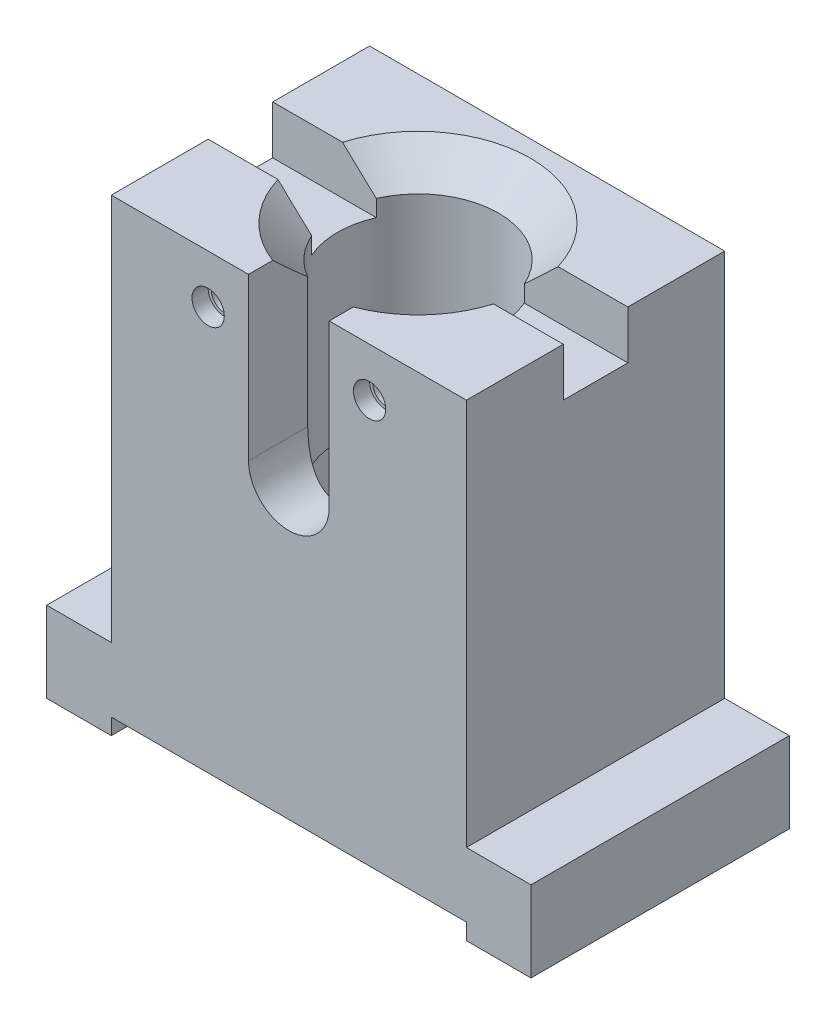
from build123d import *

# Parameters (mm, degrees)
EXTRUDE_1_DEPTH              = 8
SKETCH_3_W                   = 4
SKETCH_3_H                   = 3
CUT_EXTRUDE_1_DEPTH          = 40.038442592
SKETCH_5_W                   = 1.5
SKETCH_5_H                   = 3.731217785
HOLE_WIZARD_M2_1_D           = 1.6
HOLE_WIZARD_M2_1_DEPTH       = 2
HOLE_WIZARD_M2_1_CBORE_D     = 2
HOLE_WIZARD_M2_1_CBORE_DEPTH = 1
HOLE_WIZARD_M2_1_TIP         = 0.480688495
CUT_EXTRUDE_2_REACH          = 37.567


with BuildPart() as part:
    # Sketch 1 → Extrude 1 (new, symmetric)
    with BuildSketch(Plane.XY):
        Polygon((11, 0), (-11, 0), (-11, -1), (-15, -1), (-15, 4), (-11, 4), (-11, 28), (11, 28), (11, 4), (15, 4), (15, -1), (11, -1), align=None)
    extrude(amount=EXTRUDE_1_DEPTH, both=True)

    # Sketch 2 → Cut-Revolve 1 (revolve, cut)
    with BuildSketch(Plane.XY, mode=Mode.PRIVATE) as cut_revolve_1_sk:
        Polygon((0, 3.730217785), (6, 3.730217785), (6, 13.730217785), (5, 13.730217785), (5, 26.032051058), (6.967948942, 28), (0, 28), align=None)
    revolve(cut_revolve_1_sk.sketch.rotate(Axis((0, 28, 0), (0, -1, 0)), 90), axis=Axis((0, 28, 0), (0, -1, 0)), mode=Mode.SUBTRACT)

    # Sketch 3 → Cut-Extrude 1 (cut, through all)
    with BuildSketch(Plane.ZY.offset(11)):
        with Locations((0, 26.5)):
            Rectangle(SKETCH_3_W, SKETCH_3_H)
    extrude(amount=-CUT_EXTRUDE_1_DEPTH, mode=Mode.SUBTRACT)

    # Sketch 5 → Hole Wizard M3 _1 (revolve, cut)
    with BuildSketch(Plane(origin=(0, 3.730217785, 0), x_dir=(0, 0, 1), z_dir=(1, 0, 0))):
        with Locations((0.75, 1.865608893)):
            Rectangle(SKETCH_5_W, SKETCH_5_H)
    revolve(axis=Axis((0, 10.080217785, 0), (0, -1, 0)), mode=Mode.SUBTRACT)

    # Hole Wizard M2 _1
    with Locations(Plane(origin=(-5, 25, 8), x_dir=(1, 0, 0), z_dir=(0, 0, 1))):
        with Locations((0, 0), (10, 0)):
            CounterBoreHole(HOLE_WIZARD_M2_1_D / 2, HOLE_WIZARD_M2_1_CBORE_D / 2, HOLE_WIZARD_M2_1_CBORE_DEPTH, depth=HOLE_WIZARD_M2_1_DEPTH)
            with Locations((0, 0, -(HOLE_WIZARD_M2_1_DEPTH + HOLE_WIZARD_M2_1_TIP / 2))):  # 118° drill point
                Cone(0, HOLE_WIZARD_M2_1_D / 2, HOLE_WIZARD_M2_1_TIP, mode=Mode.SUBTRACT)

    # Sketch 8 → Cut-Extrude 2 (cut, up to next)
    with BuildSketch(Plane.XY.offset(8), mode=Mode.PRIVATE) as cut_extrude_2_sk1:
        with BuildLine():
            Line((-2.5, 18), (-2.5, 28))
            Line((-2.5, 28), (2.5, 28))
            Line((2.5, 28), (2.5, 18))
            ThreePointArc((2.5, 18), (0, 15.5), (-2.5, 18))
        make_face()
    cut_extrude_2_tool1 = extrude(cut_extrude_2_sk1.sketch, amount=-CUT_EXTRUDE_2_REACH, mode=Mode.PRIVATE) & part.part
    add(cut_extrude_2_tool1.solids().sort_by_distance((0, 22.00524, 8))[0], mode=Mode.SUBTRACT)


solid = part.part
